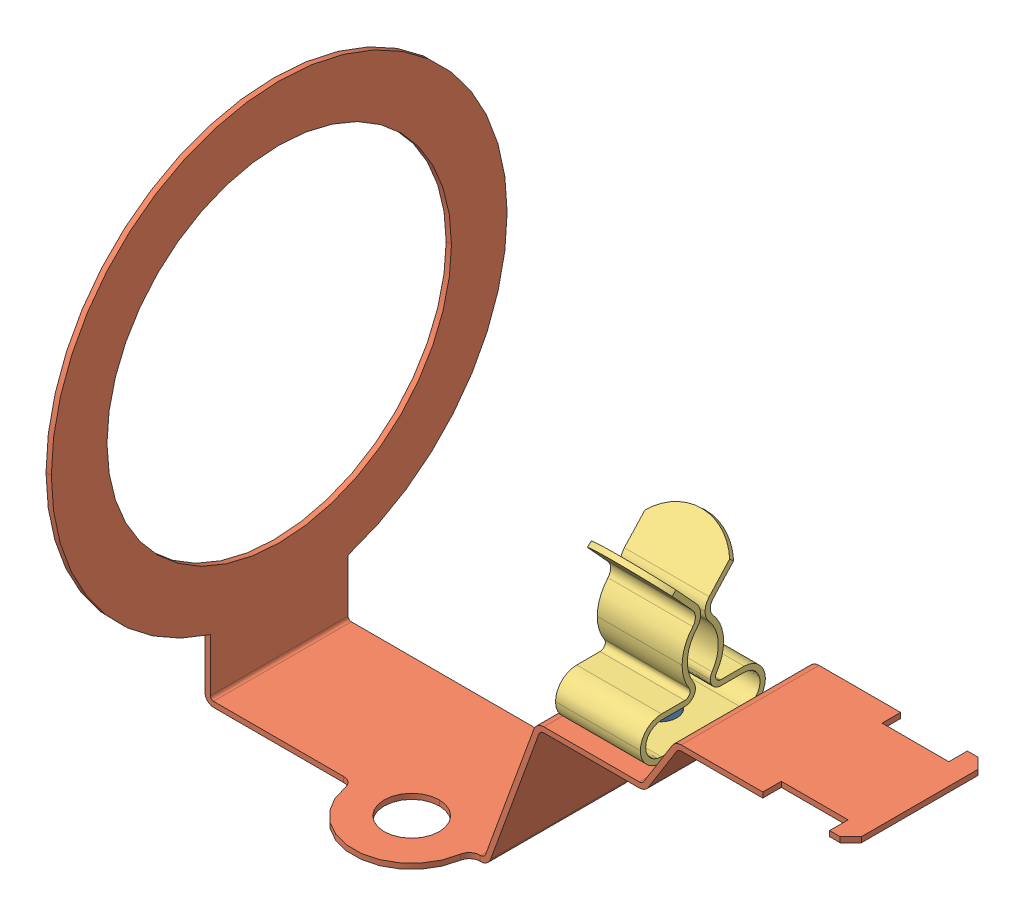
SolidWorks assembly 37181_2.SLDASM, configuration Default (file format 8000). Lengths in mm.
Overall size (60.92 47.79 43).
3 component instances, 3 part files, 0 mates.
Components (placement in the parent):
- 37181_2_01-1: 37181_2_01.SLDPRT [Default] at origin size (6 4.5 6)
- 37181_2_02-1: 37181_2_02.SLDPRT [Default] at origin size (60.92 47.79 43)
- 37181_2_03-1: 37181_2_03.SLDPRT [Default] at origin size (8 14.92 11.8)
